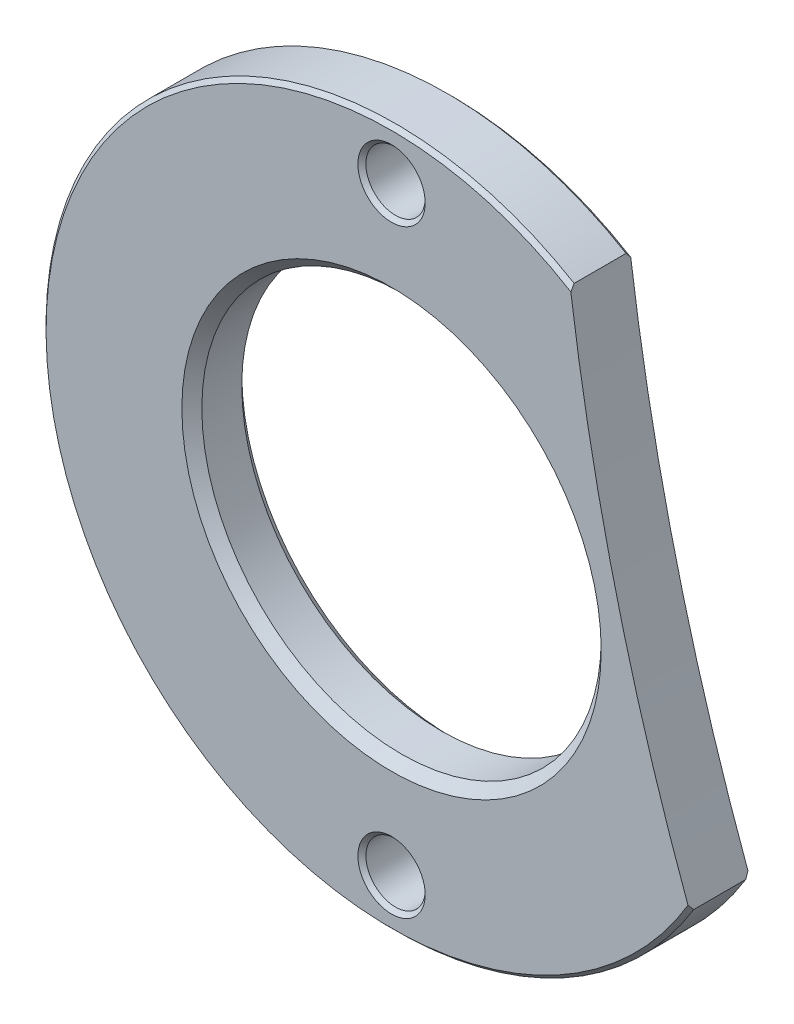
ISO-10303-21;
HEADER;
FILE_DESCRIPTION(('STEP AP214'),'2;1');
FILE_NAME('part.step','',(''),(''),'','','');
FILE_SCHEMA(('AUTOMOTIVE_DESIGN { 1 0 10303 214 1 1 1 1 }'));
ENDSEC;
DATA;
#1=APPLICATION_CONTEXT('core data for automotive mechanical design processes');
#2=APPLICATION_PROTOCOL_DEFINITION('international standard','automotive_design',2000,#1);
#3=PRODUCT_CONTEXT('',#1,'mechanical');
#4=PRODUCT('Part','Part','',(#3));
#5=PRODUCT_RELATED_PRODUCT_CATEGORY('part','',(#4));
#6=PRODUCT_DEFINITION_FORMATION('','',#4);
#7=PRODUCT_DEFINITION_CONTEXT('part definition',#1,'design');
#8=PRODUCT_DEFINITION('design','',#6,#7);
#9=PRODUCT_DEFINITION_SHAPE('','',#8);
#10=(LENGTH_UNIT() NAMED_UNIT(*) SI_UNIT(.MILLI.,.METRE.));
#11=(NAMED_UNIT(*) PLANE_ANGLE_UNIT() SI_UNIT($,.RADIAN.));
#12=(NAMED_UNIT(*) SI_UNIT($,.STERADIAN.) SOLID_ANGLE_UNIT());
#13=UNCERTAINTY_MEASURE_WITH_UNIT(LENGTH_MEASURE(1.E-05),#10,'distance_accuracy_value','');
#14=(GEOMETRIC_REPRESENTATION_CONTEXT(3) GLOBAL_UNCERTAINTY_ASSIGNED_CONTEXT((#13)) GLOBAL_UNIT_ASSIGNED_CONTEXT((#10,
#11,#12)) REPRESENTATION_CONTEXT('',''));
#15=CARTESIAN_POINT('',(0.,0.,0.));
#16=DIRECTION('',(0.,0.,1.));
#17=DIRECTION('',(1.,0.,0.));
#18=AXIS2_PLACEMENT_3D('',#15,#16,#17);
#19=CARTESIAN_POINT('',(59.5,14.75,3.));
#20=DIRECTION('',(0.,0.,1.));
#21=DIRECTION('',(1.,0.,0.));
#22=AXIS2_PLACEMENT_3D('',#19,#20,#21);
#23=PLANE('',#22);
#24=CARTESIAN_POINT('',(0.,-15.,3.));
#25=DIRECTION('',(0.,0.,1.));
#26=DIRECTION('',(1.,0.,0.));
#27=AXIS2_PLACEMENT_3D('',#24,#25,#26);
#28=CIRCLE('',#27,1.68499999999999);
#29=CARTESIAN_POINT('',(1.685,-15.,3.));
#30=VERTEX_POINT('',#29);
#31=EDGE_CURVE('E186',#30,#30,#28,.F.);
#32=ORIENTED_EDGE('',*,*,#31,.T.);
#33=EDGE_LOOP('',(#32));
#34=FACE_BOUND('',#33,.T.);
#35=CARTESIAN_POINT('',(0.,15.,3.));
#36=DIRECTION('',(0.,0.,1.));
#37=DIRECTION('',(1.,0.,0.));
#38=AXIS2_PLACEMENT_3D('',#35,#36,#37);
#39=CIRCLE('',#38,1.68499999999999);
#40=CARTESIAN_POINT('',(1.685,15.,3.));
#41=VERTEX_POINT('',#40);
#42=EDGE_CURVE('E188',#41,#41,#39,.F.);
#43=ORIENTED_EDGE('',*,*,#42,.T.);
#44=EDGE_LOOP('',(#43));
#45=FACE_BOUND('',#44,.T.);
#46=CARTESIAN_POINT('',(0.,0.,3.));
#47=DIRECTION('',(0.,0.,1.));
#48=DIRECTION('',(1.,0.,0.));
#49=AXIS2_PLACEMENT_3D('',#46,#47,#48);
#50=CIRCLE('',#49,10.5);
#51=CARTESIAN_POINT('',(10.5,0.,3.));
#52=VERTEX_POINT('',#51);
#53=EDGE_CURVE('E197',#52,#52,#50,.F.);
#54=ORIENTED_EDGE('',*,*,#53,.T.);
#55=EDGE_LOOP('',(#54));
#56=FACE_BOUND('',#55,.T.);
#57=CARTESIAN_POINT('',(119.,29.5,3.));
#58=DIRECTION('',(0.,0.,-1.));
#59=DIRECTION('',(1.,0.,0.));
#60=AXIS2_PLACEMENT_3D('',#57,#58,#59);
#61=CIRCLE('',#60,111.);
#62=CARTESIAN_POINT('',(14.8466473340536,-8.88071297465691,3.));
#63=VERTEX_POINT('',#62);
#64=CARTESIAN_POINT('',(8.97939906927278,14.7871698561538,3.));
#65=VERTEX_POINT('',#64);
#66=EDGE_CURVE('E83',#63,#65,#61,.T.);
#67=ORIENTED_EDGE('',*,*,#66,.T.);
#68=CARTESIAN_POINT('',(0.,0.,3.));
#69=DIRECTION('',(0.,0.,1.));
#70=DIRECTION('',(1.,0.,0.));
#71=AXIS2_PLACEMENT_3D('',#68,#69,#70);
#72=CIRCLE('',#71,17.3);
#73=EDGE_CURVE('E203',#65,#63,#72,.T.);
#74=ORIENTED_EDGE('',*,*,#73,.T.);
#75=EDGE_LOOP('',(#67,#74));
#76=FACE_BOUND('',#75,.T.);
#77=ADVANCED_FACE('F38',(#34,#45,#56,#76),#23,.T.);
#78=CARTESIAN_POINT('',(59.5,14.75,0.));
#79=DIRECTION('',(0.,0.,1.));
#80=DIRECTION('',(1.,0.,0.));
#81=AXIS2_PLACEMENT_3D('',#78,#79,#80);
#82=PLANE('',#81);
#83=CARTESIAN_POINT('',(0.,-15.,0.));
#84=DIRECTION('',(0.,0.,1.));
#85=DIRECTION('',(1.,0.,0.));
#86=AXIS2_PLACEMENT_3D('',#83,#84,#85);
#87=CIRCLE('',#86,1.685);
#88=CARTESIAN_POINT('',(1.685,-15.,0.));
#89=VERTEX_POINT('',#88);
#90=EDGE_CURVE('E179',#89,#89,#87,.T.);
#91=ORIENTED_EDGE('',*,*,#90,.T.);
#92=EDGE_LOOP('',(#91));
#93=FACE_BOUND('',#92,.T.);
#94=CARTESIAN_POINT('',(0.,15.,0.));
#95=DIRECTION('',(0.,0.,1.));
#96=DIRECTION('',(1.,0.,0.));
#97=AXIS2_PLACEMENT_3D('',#94,#95,#96);
#98=CIRCLE('',#97,1.685);
#99=CARTESIAN_POINT('',(1.685,15.,0.));
#100=VERTEX_POINT('',#99);
#101=EDGE_CURVE('E181',#100,#100,#98,.T.);
#102=ORIENTED_EDGE('',*,*,#101,.T.);
#103=EDGE_LOOP('',(#102));
#104=FACE_BOUND('',#103,.T.);
#105=CARTESIAN_POINT('',(0.,0.,0.));
#106=DIRECTION('',(0.,0.,1.));
#107=DIRECTION('',(1.,0.,0.));
#108=AXIS2_PLACEMENT_3D('',#105,#106,#107);
#109=CIRCLE('',#108,10.5);
#110=CARTESIAN_POINT('',(10.5,0.,0.));
#111=VERTEX_POINT('',#110);
#112=EDGE_CURVE('E100',#111,#111,#109,.T.);
#113=ORIENTED_EDGE('',*,*,#112,.T.);
#114=EDGE_LOOP('',(#113));
#115=FACE_BOUND('',#114,.T.);
#116=CARTESIAN_POINT('',(119.,29.5,0.));
#117=DIRECTION('',(0.,0.,-1.));
#118=DIRECTION('',(1.,0.,0.));
#119=AXIS2_PLACEMENT_3D('',#116,#117,#118);
#120=CIRCLE('',#119,111.);
#121=CARTESIAN_POINT('',(14.8466473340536,-8.88071297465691,0.));
#122=VERTEX_POINT('',#121);
#123=CARTESIAN_POINT('',(8.97939906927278,14.7871698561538,0.));
#124=VERTEX_POINT('',#123);
#125=EDGE_CURVE('E209',#122,#124,#120,.T.);
#126=ORIENTED_EDGE('',*,*,#125,.F.);
#127=CARTESIAN_POINT('',(0.,0.,0.));
#128=DIRECTION('',(0.,0.,1.));
#129=DIRECTION('',(1.,0.,0.));
#130=AXIS2_PLACEMENT_3D('',#127,#128,#129);
#131=CIRCLE('',#130,17.3);
#132=EDGE_CURVE('E204',#122,#124,#131,.F.);
#133=ORIENTED_EDGE('',*,*,#132,.T.);
#134=EDGE_LOOP('',(#126,#133));
#135=FACE_BOUND('',#134,.T.);
#136=ADVANCED_FACE('F122',(#93,#104,#115,#135),#82,.F.);
#137=CARTESIAN_POINT('',(119.,29.5,3.));
#138=DIRECTION('',(0.,0.,-1.));
#139=DIRECTION('',(-1.,0.,0.));
#140=AXIS2_PLACEMENT_3D('',#137,#138,#139);
#141=CYLINDRICAL_SURFACE('',#140,111.);
#142=DIRECTION('',(0.,0.,-1.));
#143=VECTOR('',#142,1.);
#144=CARTESIAN_POINT('',(14.9353560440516,-9.12058878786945,3.));
#145=LINE('',#144,#143);
#146=CARTESIAN_POINT('',(14.9353560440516,-9.12058878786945,2.8));
#147=VERTEX_POINT('',#146);
#148=CARTESIAN_POINT('',(14.9353560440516,-9.12058878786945,0.200000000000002));
#149=VERTEX_POINT('',#148);
#150=EDGE_CURVE('E82',#147,#149,#145,.T.);
#151=ORIENTED_EDGE('',*,*,#150,.T.);
#152=CARTESIAN_POINT('',(14.9353560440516,-9.12058878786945,0.200000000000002));
#153=CARTESIAN_POINT('',(14.9205508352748,-9.08069583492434,0.166572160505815));
#154=CARTESIAN_POINT('',(14.9057558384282,-9.0407597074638,0.133191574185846));
#155=CARTESIAN_POINT('',(14.8761862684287,-8.9608011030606,0.066524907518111));
#156=CARTESIAN_POINT('',(14.8614116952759,-8.92077862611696,0.0332388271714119));
#157=CARTESIAN_POINT('',(14.8466473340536,-8.88071297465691,0.));
#158=B_SPLINE_CURVE_WITH_KNOTS('',3,(#152,#153,#154,#155,#156,#157),.UNSPECIFIED.,.F.,.F.,(4,2,
4),(0.,0.162334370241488,0.324668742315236),.UNSPECIFIED.);
#159=EDGE_CURVE('E133',#149,#122,#158,.T.);
#160=ORIENTED_EDGE('',*,*,#159,.T.);
#161=ORIENTED_EDGE('',*,*,#125,.T.);
#162=CARTESIAN_POINT('',(8.97939906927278,14.7871698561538,0.));
#163=CARTESIAN_POINT('',(8.97373942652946,14.8294925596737,0.0332388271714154));
#164=CARTESIAN_POINT('',(8.96810897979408,14.8717818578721,0.0665249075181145));
#165=CARTESIAN_POINT('',(8.95690647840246,14.9562936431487,0.133191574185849));
#166=CARTESIAN_POINT('',(8.95133442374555,14.9985161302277,0.166572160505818));
#167=CARTESIAN_POINT('',(8.94579156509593,15.0407052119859,0.200000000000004));
#168=B_SPLINE_CURVE_WITH_KNOTS('',3,(#162,#163,#164,#165,#166,#167),.UNSPECIFIED.,.F.,.F.,(4,2,
4),(0.,0.162334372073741,0.324668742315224),.UNSPECIFIED.);
#169=CARTESIAN_POINT('',(8.94579156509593,15.0407052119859,0.200000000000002));
#170=VERTEX_POINT('',#169);
#171=EDGE_CURVE('E84',#124,#170,#168,.T.);
#172=ORIENTED_EDGE('',*,*,#171,.T.);
#173=DIRECTION('',(0.,0.,-1.));
#174=VECTOR('',#173,1.);
#175=CARTESIAN_POINT('',(8.94579156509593,15.0407052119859,3.));
#176=LINE('',#175,#174);
#177=CARTESIAN_POINT('',(8.94579156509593,15.0407052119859,2.8));
#178=VERTEX_POINT('',#177);
#179=EDGE_CURVE('E93',#178,#170,#176,.T.);
#180=ORIENTED_EDGE('',*,*,#179,.F.);
#181=CARTESIAN_POINT('',(8.94579156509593,15.0407052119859,2.8));
#182=CARTESIAN_POINT('',(8.95133442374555,14.9985161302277,2.83342783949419));
#183=CARTESIAN_POINT('',(8.95690647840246,14.9562936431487,2.86680842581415));
#184=CARTESIAN_POINT('',(8.96810897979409,14.8717818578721,2.93347509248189));
#185=CARTESIAN_POINT('',(8.97373942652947,14.8294925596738,2.96676117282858));
#186=CARTESIAN_POINT('',(8.97939906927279,14.7871698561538,3.));
#187=B_SPLINE_CURVE_WITH_KNOTS('',3,(#181,#182,#183,#184,#185,#186),.UNSPECIFIED.,.F.,.F.,(4,2,
4),(0.,0.162334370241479,0.324668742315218),.UNSPECIFIED.);
#188=EDGE_CURVE('E53',#178,#65,#187,.T.);
#189=ORIENTED_EDGE('',*,*,#188,.T.);
#190=ORIENTED_EDGE('',*,*,#66,.F.);
#191=CARTESIAN_POINT('',(14.8466473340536,-8.88071297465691,3.));
#192=CARTESIAN_POINT('',(14.8614116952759,-8.92077862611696,2.96676117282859));
#193=CARTESIAN_POINT('',(14.8761862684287,-8.9608011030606,2.93347509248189));
#194=CARTESIAN_POINT('',(14.9057558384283,-9.0407597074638,2.86680842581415));
#195=CARTESIAN_POINT('',(14.9205508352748,-9.08069583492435,2.83342783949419));
#196=CARTESIAN_POINT('',(14.9353560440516,-9.12058878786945,2.8));
#197=B_SPLINE_CURVE_WITH_KNOTS('',3,(#191,#192,#193,#194,#195,#196),.UNSPECIFIED.,.F.,.F.,(4,2,
4),(0.,0.162334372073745,0.324668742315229),.UNSPECIFIED.);
#198=EDGE_CURVE('E61',#63,#147,#197,.T.);
#199=ORIENTED_EDGE('',*,*,#198,.T.);
#200=EDGE_LOOP('',(#151,#160,#161,#172,#180,#189,#190,#199));
#201=FACE_BOUND('',#200,.T.);
#202=ADVANCED_FACE('F81',(#201),#141,.F.);
#203=CARTESIAN_POINT('',(0.,0.,3.));
#204=DIRECTION('',(0.,0.,-1.));
#205=DIRECTION('',(-1.,0.,0.));
#206=AXIS2_PLACEMENT_3D('',#203,#204,#205);
#207=CYLINDRICAL_SURFACE('',#206,17.5);
#208=ORIENTED_EDGE('',*,*,#179,.T.);
#209=CARTESIAN_POINT('',(0.,0.,0.200000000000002));
#210=DIRECTION('',(0.,0.,1.));
#211=DIRECTION('',(1.,0.,0.));
#212=AXIS2_PLACEMENT_3D('',#209,#210,#211);
#213=CIRCLE('',#212,17.5);
#214=EDGE_CURVE('E92',#170,#149,#213,.T.);
#215=ORIENTED_EDGE('',*,*,#214,.T.);
#216=ORIENTED_EDGE('',*,*,#150,.F.);
#217=CARTESIAN_POINT('',(0.,0.,2.8));
#218=DIRECTION('',(0.,0.,1.));
#219=DIRECTION('',(1.,0.,0.));
#220=AXIS2_PLACEMENT_3D('',#217,#218,#219);
#221=CIRCLE('',#220,17.5);
#222=EDGE_CURVE('E90',#147,#178,#221,.F.);
#223=ORIENTED_EDGE('',*,*,#222,.T.);
#224=EDGE_LOOP('',(#208,#215,#216,#223));
#225=FACE_BOUND('',#224,.T.);
#226=ADVANCED_FACE('F89',(#225),#207,.T.);
#227=CARTESIAN_POINT('',(0.,0.,3.));
#228=DIRECTION('',(0.,0.,-1.));
#229=DIRECTION('',(-1.,0.,0.));
#230=AXIS2_PLACEMENT_3D('',#227,#228,#229);
#231=CYLINDRICAL_SURFACE('',#230,10.);
#232=CARTESIAN_POINT('',(0.,0.,2.49999999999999));
#233=DIRECTION('',(0.,0.,1.));
#234=DIRECTION('',(1.,0.,0.));
#235=AXIS2_PLACEMENT_3D('',#232,#233,#234);
#236=CIRCLE('',#235,10.);
#237=CARTESIAN_POINT('',(10.,0.,2.49999999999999));
#238=VERTEX_POINT('',#237);
#239=EDGE_CURVE('E200',#238,#238,#236,.T.);
#240=ORIENTED_EDGE('',*,*,#239,.T.);
#241=EDGE_LOOP('',(#240));
#242=FACE_BOUND('',#241,.T.);
#243=CARTESIAN_POINT('',(0.,0.,0.500000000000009));
#244=DIRECTION('',(0.,0.,1.));
#245=DIRECTION('',(1.,0.,0.));
#246=AXIS2_PLACEMENT_3D('',#243,#244,#245);
#247=CIRCLE('',#246,10.);
#248=CARTESIAN_POINT('',(10.,0.,0.500000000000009));
#249=VERTEX_POINT('',#248);
#250=EDGE_CURVE('E96',#249,#249,#247,.F.);
#251=ORIENTED_EDGE('',*,*,#250,.T.);
#252=EDGE_LOOP('',(#251));
#253=FACE_BOUND('',#252,.T.);
#254=ADVANCED_FACE('F162',(#242,#253),#231,.F.);
#255=CARTESIAN_POINT('',(0.,-15.,3.));
#256=DIRECTION('',(0.,0.,1.));
#257=DIRECTION('',(1.,0.,0.));
#258=AXIS2_PLACEMENT_3D('',#255,#256,#257);
#259=CYLINDRICAL_SURFACE('',#258,1.48499999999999);
#260=CARTESIAN_POINT('',(0.,-15.,2.8));
#261=DIRECTION('',(0.,0.,1.));
#262=DIRECTION('',(1.,0.,0.));
#263=AXIS2_PLACEMENT_3D('',#260,#261,#262);
#264=CIRCLE('',#263,1.48499999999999);
#265=CARTESIAN_POINT('',(1.485,-15.,2.8));
#266=VERTEX_POINT('',#265);
#267=EDGE_CURVE('E191',#266,#266,#264,.T.);
#268=ORIENTED_EDGE('',*,*,#267,.T.);
#269=EDGE_LOOP('',(#268));
#270=FACE_BOUND('',#269,.T.);
#271=CARTESIAN_POINT('',(0.,-15.,0.200000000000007));
#272=DIRECTION('',(0.,0.,1.));
#273=DIRECTION('',(1.,0.,0.));
#274=AXIS2_PLACEMENT_3D('',#271,#272,#273);
#275=CIRCLE('',#274,1.48499999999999);
#276=CARTESIAN_POINT('',(1.485,-15.,0.200000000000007));
#277=VERTEX_POINT('',#276);
#278=EDGE_CURVE('E194',#277,#277,#275,.F.);
#279=ORIENTED_EDGE('',*,*,#278,.T.);
#280=EDGE_LOOP('',(#279));
#281=FACE_BOUND('',#280,.T.);
#282=ADVANCED_FACE('F165',(#270,#281),#259,.F.);
#283=CARTESIAN_POINT('',(0.,15.,3.));
#284=DIRECTION('',(0.,0.,1.));
#285=DIRECTION('',(1.,0.,0.));
#286=AXIS2_PLACEMENT_3D('',#283,#284,#285);
#287=CYLINDRICAL_SURFACE('',#286,1.48499999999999);
#288=CARTESIAN_POINT('',(0.,15.,2.8));
#289=DIRECTION('',(0.,0.,1.));
#290=DIRECTION('',(1.,0.,0.));
#291=AXIS2_PLACEMENT_3D('',#288,#289,#290);
#292=CIRCLE('',#291,1.48499999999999);
#293=CARTESIAN_POINT('',(1.485,15.,2.8));
#294=VERTEX_POINT('',#293);
#295=EDGE_CURVE('E11',#294,#294,#292,.T.);
#296=ORIENTED_EDGE('',*,*,#295,.T.);
#297=EDGE_LOOP('',(#296));
#298=FACE_BOUND('',#297,.T.);
#299=CARTESIAN_POINT('',(0.,15.,0.200000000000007));
#300=DIRECTION('',(0.,0.,1.));
#301=DIRECTION('',(1.,0.,0.));
#302=AXIS2_PLACEMENT_3D('',#299,#300,#301);
#303=CIRCLE('',#302,1.48499999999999);
#304=CARTESIAN_POINT('',(1.485,15.,0.200000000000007));
#305=VERTEX_POINT('',#304);
#306=EDGE_CURVE('E46',#305,#305,#303,.F.);
#307=ORIENTED_EDGE('',*,*,#306,.T.);
#308=EDGE_LOOP('',(#307));
#309=FACE_BOUND('',#308,.T.);
#310=ADVANCED_FACE('F149',(#298,#309),#287,.F.);
#311=CARTESIAN_POINT('',(0.,0.,0.));
#312=DIRECTION('',(0.,0.,-1.));
#313=DIRECTION('',(-1.,0.,0.));
#314=AXIS2_PLACEMENT_3D('',#311,#312,#313);
#315=CONICAL_SURFACE('',#314,10.5,0.785398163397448);
#316=ORIENTED_EDGE('',*,*,#250,.F.);
#317=EDGE_LOOP('',(#316));
#318=FACE_BOUND('',#317,.T.);
#319=ORIENTED_EDGE('',*,*,#112,.F.);
#320=EDGE_LOOP('',(#319));
#321=FACE_BOUND('',#320,.T.);
#322=ADVANCED_FACE('F124',(#318,#321),#315,.F.);
#323=CARTESIAN_POINT('',(0.,0.,0.200000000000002));
#324=DIRECTION('',(0.,0.,1.));
#325=DIRECTION('',(1.,0.,0.));
#326=AXIS2_PLACEMENT_3D('',#323,#324,#325);
#327=CONICAL_SURFACE('',#326,17.5,0.785398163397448);
#328=ORIENTED_EDGE('',*,*,#171,.F.);
#329=ORIENTED_EDGE('',*,*,#132,.F.);
#330=ORIENTED_EDGE('',*,*,#159,.F.);
#331=ORIENTED_EDGE('',*,*,#214,.F.);
#332=EDGE_LOOP('',(#328,#329,#330,#331));
#333=FACE_BOUND('',#332,.T.);
#334=ADVANCED_FACE('F139',(#333),#327,.T.);
#335=CARTESIAN_POINT('',(0.,0.,3.));
#336=DIRECTION('',(0.,0.,-1.));
#337=DIRECTION('',(-1.,0.,0.));
#338=AXIS2_PLACEMENT_3D('',#335,#336,#337);
#339=CONICAL_SURFACE('',#338,17.3,0.78539816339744);
#340=ORIENTED_EDGE('',*,*,#188,.F.);
#341=ORIENTED_EDGE('',*,*,#222,.F.);
#342=ORIENTED_EDGE('',*,*,#198,.F.);
#343=ORIENTED_EDGE('',*,*,#73,.F.);
#344=EDGE_LOOP('',(#340,#341,#342,#343));
#345=FACE_BOUND('',#344,.T.);
#346=ADVANCED_FACE('F95',(#345),#339,.T.);
#347=CARTESIAN_POINT('',(0.,0.,2.49999999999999));
#348=DIRECTION('',(0.,0.,1.));
#349=DIRECTION('',(1.,0.,0.));
#350=AXIS2_PLACEMENT_3D('',#347,#348,#349);
#351=CONICAL_SURFACE('',#350,10.,0.785398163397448);
#352=ORIENTED_EDGE('',*,*,#53,.F.);
#353=EDGE_LOOP('',(#352));
#354=FACE_BOUND('',#353,.T.);
#355=ORIENTED_EDGE('',*,*,#239,.F.);
#356=EDGE_LOOP('',(#355));
#357=FACE_BOUND('',#356,.T.);
#358=ADVANCED_FACE('F148',(#354,#357),#351,.F.);
#359=CARTESIAN_POINT('',(0.,-15.,2.8));
#360=DIRECTION('',(0.,0.,1.));
#361=DIRECTION('',(1.,0.,0.));
#362=AXIS2_PLACEMENT_3D('',#359,#360,#361);
#363=CONICAL_SURFACE('',#362,1.48499999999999,0.785398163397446);
#364=CARTESIAN_POINT('',(1.685,-15.,3.));
#365=CARTESIAN_POINT('',(1.68291666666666,-15.,2.99791666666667));
#366=CARTESIAN_POINT('',(1.68083333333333,-15.,2.99583333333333));
#367=CARTESIAN_POINT('',(1.67666666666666,-15.,2.99166666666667));
#368=CARTESIAN_POINT('',(1.67458333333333,-15.,2.98958333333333));
#369=CARTESIAN_POINT('',(1.67041666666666,-15.,2.98541666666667));
#370=CARTESIAN_POINT('',(1.66833333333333,-15.,2.98333333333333));
#371=CARTESIAN_POINT('',(1.66416666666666,-15.,2.97916666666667));
#372=CARTESIAN_POINT('',(1.66208333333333,-15.,2.97708333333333));
#373=CARTESIAN_POINT('',(1.65791666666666,-15.,2.97291666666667));
#374=CARTESIAN_POINT('',(1.65583333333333,-15.,2.97083333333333));
#375=CARTESIAN_POINT('',(1.65166666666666,-15.,2.96666666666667));
#376=CARTESIAN_POINT('',(1.64958333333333,-15.,2.96458333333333));
#377=CARTESIAN_POINT('',(1.64541666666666,-15.,2.96041666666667));
#378=CARTESIAN_POINT('',(1.64333333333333,-15.,2.95833333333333));
#379=CARTESIAN_POINT('',(1.63916666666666,-15.,2.95416666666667));
#380=CARTESIAN_POINT('',(1.63708333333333,-15.,2.95208333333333));
#381=CARTESIAN_POINT('',(1.63291666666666,-15.,2.94791666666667));
#382=CARTESIAN_POINT('',(1.63083333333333,-15.,2.94583333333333));
#383=CARTESIAN_POINT('',(1.62666666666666,-15.,2.94166666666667));
#384=CARTESIAN_POINT('',(1.62458333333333,-15.,2.93958333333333));
#385=CARTESIAN_POINT('',(1.62041666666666,-15.,2.93541666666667));
#386=CARTESIAN_POINT('',(1.61833333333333,-15.,2.93333333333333));
#387=CARTESIAN_POINT('',(1.61416666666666,-15.,2.92916666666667));
#388=CARTESIAN_POINT('',(1.61208333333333,-15.,2.92708333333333));
#389=CARTESIAN_POINT('',(1.60791666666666,-15.,2.92291666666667));
#390=CARTESIAN_POINT('',(1.60583333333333,-15.,2.92083333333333));
#391=CARTESIAN_POINT('',(1.60166666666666,-15.,2.91666666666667));
#392=CARTESIAN_POINT('',(1.59958333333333,-15.,2.91458333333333));
#393=CARTESIAN_POINT('',(1.59541666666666,-15.,2.91041666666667));
#394=CARTESIAN_POINT('',(1.59333333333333,-15.,2.90833333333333));
#395=CARTESIAN_POINT('',(1.58916666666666,-15.,2.90416666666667));
#396=CARTESIAN_POINT('',(1.58708333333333,-15.,2.90208333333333));
#397=CARTESIAN_POINT('',(1.58291666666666,-15.,2.89791666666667));
#398=CARTESIAN_POINT('',(1.58083333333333,-15.,2.89583333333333));
#399=CARTESIAN_POINT('',(1.57666666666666,-15.,2.89166666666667));
#400=CARTESIAN_POINT('',(1.57458333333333,-15.,2.88958333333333));
#401=CARTESIAN_POINT('',(1.57041666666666,-15.,2.88541666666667));
#402=CARTESIAN_POINT('',(1.56833333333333,-15.,2.88333333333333));
#403=CARTESIAN_POINT('',(1.56416666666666,-15.,2.87916666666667));
#404=CARTESIAN_POINT('',(1.56208333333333,-15.,2.87708333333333));
#405=CARTESIAN_POINT('',(1.55791666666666,-15.,2.87291666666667));
#406=CARTESIAN_POINT('',(1.55583333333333,-15.,2.87083333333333));
#407=CARTESIAN_POINT('',(1.55166666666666,-15.,2.86666666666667));
#408=CARTESIAN_POINT('',(1.54958333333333,-15.,2.86458333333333));
#409=CARTESIAN_POINT('',(1.54541666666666,-15.,2.86041666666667));
#410=CARTESIAN_POINT('',(1.54333333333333,-15.,2.85833333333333));
#411=CARTESIAN_POINT('',(1.53916666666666,-15.,2.85416666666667));
#412=CARTESIAN_POINT('',(1.53708333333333,-15.,2.85208333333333));
#413=CARTESIAN_POINT('',(1.53291666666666,-15.,2.84791666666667));
#414=CARTESIAN_POINT('',(1.53083333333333,-15.,2.84583333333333));
#415=CARTESIAN_POINT('',(1.52666666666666,-15.,2.84166666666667));
#416=CARTESIAN_POINT('',(1.52458333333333,-15.,2.83958333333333));
#417=CARTESIAN_POINT('',(1.52041666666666,-15.,2.83541666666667));
#418=CARTESIAN_POINT('',(1.51833333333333,-15.,2.83333333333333));
#419=CARTESIAN_POINT('',(1.51416666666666,-15.,2.82916666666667));
#420=CARTESIAN_POINT('',(1.51208333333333,-15.,2.82708333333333));
#421=CARTESIAN_POINT('',(1.50791666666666,-15.,2.82291666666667));
#422=CARTESIAN_POINT('',(1.50583333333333,-15.,2.82083333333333));
#423=CARTESIAN_POINT('',(1.50166666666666,-15.,2.81666666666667));
#424=CARTESIAN_POINT('',(1.49958333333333,-15.,2.81458333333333));
#425=CARTESIAN_POINT('',(1.49541666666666,-15.,2.81041666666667));
#426=CARTESIAN_POINT('',(1.49333333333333,-15.,2.80833333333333));
#427=CARTESIAN_POINT('',(1.48916666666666,-15.,2.80416666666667));
#428=CARTESIAN_POINT('',(1.48708333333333,-15.,2.80208333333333));
#429=CARTESIAN_POINT('',(1.485,-15.,2.8));
#430=B_SPLINE_CURVE_WITH_KNOTS('',3,(#364,#365,#366,#367,#368,#369,#370,#371,#372,#373,#374,
#375,#376,#377,#378,#379,#380,#381,#382,#383,#384,#385,#386,#387,#388,#389,#390,#391,#392,#393,
#394,#395,#396,#397,#398,#399,#400,#401,#402,#403,#404,#405,#406,#407,#408,#409,#410,#411,#412,
#413,#414,#415,#416,#417,#418,#419,#420,#421,#422,#423,#424,#425,#426,#427,#428,#429),
.UNSPECIFIED.,.F.,.F.,(4,2,2,2,2,2,2,2,2,2,2,2,2,2,2,2,2,2,2,2,2,2,2,2,2,2,2,2,2,2,2,2,4),(0.,
0.00883883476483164,0.0176776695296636,0.0265165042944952,0.0353553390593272,0.0441941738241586,
0.0530330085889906,0.0618718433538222,0.0707106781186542,0.0795495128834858,0.0883883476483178,
0.0972271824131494,0.106066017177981,0.114904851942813,0.123743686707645,0.132582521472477,
0.141421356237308,0.15026019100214,0.159099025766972,0.167937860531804,0.176776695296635,
0.185615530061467,0.194454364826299,0.203293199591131,0.212132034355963,0.220970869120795,
0.229809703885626,0.238648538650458,0.24748737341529,0.256326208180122,0.265165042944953,
0.274003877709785,0.282842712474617),.UNSPECIFIED.);
#431=EDGE_CURVE('BSEAM222',#30,#266,#430,.T.);
#432=ORIENTED_EDGE('',*,*,#31,.F.);
#433=ORIENTED_EDGE('',*,*,#267,.F.);
#434=ORIENTED_EDGE('',*,*,#431,.T.);
#435=ORIENTED_EDGE('',*,*,#431,.F.);
#436=EDGE_LOOP('',(#432,#434,#433,#435));
#437=FACE_BOUND('',#436,.T.);
#438=ADVANCED_FACE('F222',(#437),#363,.F.);
#439=CARTESIAN_POINT('',(0.,-15.,0.));
#440=DIRECTION('',(0.,0.,-1.));
#441=DIRECTION('',(-1.,0.,0.));
#442=AXIS2_PLACEMENT_3D('',#439,#440,#441);
#443=CONICAL_SURFACE('',#442,1.685,0.785398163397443);
#444=ORIENTED_EDGE('',*,*,#278,.F.);
#445=EDGE_LOOP('',(#444));
#446=FACE_BOUND('',#445,.T.);
#447=ORIENTED_EDGE('',*,*,#90,.F.);
#448=EDGE_LOOP('',(#447));
#449=FACE_BOUND('',#448,.T.);
#450=ADVANCED_FACE('F227',(#446,#449),#443,.F.);
#451=CARTESIAN_POINT('',(0.,15.,2.8));
#452=DIRECTION('',(0.,0.,1.));
#453=DIRECTION('',(1.,0.,0.));
#454=AXIS2_PLACEMENT_3D('',#451,#452,#453);
#455=CONICAL_SURFACE('',#454,1.48499999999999,0.785398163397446);
#456=CARTESIAN_POINT('',(1.685,15.,3.));
#457=CARTESIAN_POINT('',(1.68291666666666,15.,2.99791666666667));
#458=CARTESIAN_POINT('',(1.68083333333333,15.,2.99583333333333));
#459=CARTESIAN_POINT('',(1.67666666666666,15.,2.99166666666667));
#460=CARTESIAN_POINT('',(1.67458333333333,15.,2.98958333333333));
#461=CARTESIAN_POINT('',(1.67041666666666,15.,2.98541666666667));
#462=CARTESIAN_POINT('',(1.66833333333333,15.,2.98333333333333));
#463=CARTESIAN_POINT('',(1.66416666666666,15.,2.97916666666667));
#464=CARTESIAN_POINT('',(1.66208333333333,15.,2.97708333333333));
#465=CARTESIAN_POINT('',(1.65791666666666,15.,2.97291666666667));
#466=CARTESIAN_POINT('',(1.65583333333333,15.,2.97083333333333));
#467=CARTESIAN_POINT('',(1.65166666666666,15.,2.96666666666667));
#468=CARTESIAN_POINT('',(1.64958333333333,15.,2.96458333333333));
#469=CARTESIAN_POINT('',(1.64541666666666,15.,2.96041666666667));
#470=CARTESIAN_POINT('',(1.64333333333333,15.,2.95833333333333));
#471=CARTESIAN_POINT('',(1.63916666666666,15.,2.95416666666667));
#472=CARTESIAN_POINT('',(1.63708333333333,15.,2.95208333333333));
#473=CARTESIAN_POINT('',(1.63291666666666,15.,2.94791666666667));
#474=CARTESIAN_POINT('',(1.63083333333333,15.,2.94583333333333));
#475=CARTESIAN_POINT('',(1.62666666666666,15.,2.94166666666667));
#476=CARTESIAN_POINT('',(1.62458333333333,15.,2.93958333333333));
#477=CARTESIAN_POINT('',(1.62041666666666,15.,2.93541666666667));
#478=CARTESIAN_POINT('',(1.61833333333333,15.,2.93333333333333));
#479=CARTESIAN_POINT('',(1.61416666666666,15.,2.92916666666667));
#480=CARTESIAN_POINT('',(1.61208333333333,15.,2.92708333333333));
#481=CARTESIAN_POINT('',(1.60791666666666,15.,2.92291666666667));
#482=CARTESIAN_POINT('',(1.60583333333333,15.,2.92083333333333));
#483=CARTESIAN_POINT('',(1.60166666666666,15.,2.91666666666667));
#484=CARTESIAN_POINT('',(1.59958333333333,15.,2.91458333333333));
#485=CARTESIAN_POINT('',(1.59541666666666,15.,2.91041666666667));
#486=CARTESIAN_POINT('',(1.59333333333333,15.,2.90833333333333));
#487=CARTESIAN_POINT('',(1.58916666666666,15.,2.90416666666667));
#488=CARTESIAN_POINT('',(1.58708333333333,15.,2.90208333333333));
#489=CARTESIAN_POINT('',(1.58291666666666,15.,2.89791666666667));
#490=CARTESIAN_POINT('',(1.58083333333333,15.,2.89583333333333));
#491=CARTESIAN_POINT('',(1.57666666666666,15.,2.89166666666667));
#492=CARTESIAN_POINT('',(1.57458333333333,15.,2.88958333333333));
#493=CARTESIAN_POINT('',(1.57041666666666,15.,2.88541666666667));
#494=CARTESIAN_POINT('',(1.56833333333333,15.,2.88333333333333));
#495=CARTESIAN_POINT('',(1.56416666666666,15.,2.87916666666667));
#496=CARTESIAN_POINT('',(1.56208333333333,15.,2.87708333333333));
#497=CARTESIAN_POINT('',(1.55791666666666,15.,2.87291666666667));
#498=CARTESIAN_POINT('',(1.55583333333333,15.,2.87083333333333));
#499=CARTESIAN_POINT('',(1.55166666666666,15.,2.86666666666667));
#500=CARTESIAN_POINT('',(1.54958333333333,15.,2.86458333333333));
#501=CARTESIAN_POINT('',(1.54541666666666,15.,2.86041666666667));
#502=CARTESIAN_POINT('',(1.54333333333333,15.,2.85833333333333));
#503=CARTESIAN_POINT('',(1.53916666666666,15.,2.85416666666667));
#504=CARTESIAN_POINT('',(1.53708333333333,15.,2.85208333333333));
#505=CARTESIAN_POINT('',(1.53291666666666,15.,2.84791666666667));
#506=CARTESIAN_POINT('',(1.53083333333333,15.,2.84583333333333));
#507=CARTESIAN_POINT('',(1.52666666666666,15.,2.84166666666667));
#508=CARTESIAN_POINT('',(1.52458333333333,15.,2.83958333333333));
#509=CARTESIAN_POINT('',(1.52041666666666,15.,2.83541666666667));
#510=CARTESIAN_POINT('',(1.51833333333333,15.,2.83333333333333));
#511=CARTESIAN_POINT('',(1.51416666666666,15.,2.82916666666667));
#512=CARTESIAN_POINT('',(1.51208333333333,15.,2.82708333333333));
#513=CARTESIAN_POINT('',(1.50791666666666,15.,2.82291666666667));
#514=CARTESIAN_POINT('',(1.50583333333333,15.,2.82083333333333));
#515=CARTESIAN_POINT('',(1.50166666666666,15.,2.81666666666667));
#516=CARTESIAN_POINT('',(1.49958333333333,15.,2.81458333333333));
#517=CARTESIAN_POINT('',(1.49541666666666,15.,2.81041666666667));
#518=CARTESIAN_POINT('',(1.49333333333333,15.,2.80833333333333));
#519=CARTESIAN_POINT('',(1.48916666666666,15.,2.80416666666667));
#520=CARTESIAN_POINT('',(1.48708333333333,15.,2.80208333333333));
#521=CARTESIAN_POINT('',(1.485,15.,2.8));
#522=B_SPLINE_CURVE_WITH_KNOTS('',3,(#456,#457,#458,#459,#460,#461,#462,#463,#464,#465,#466,
#467,#468,#469,#470,#471,#472,#473,#474,#475,#476,#477,#478,#479,#480,#481,#482,#483,#484,#485,
#486,#487,#488,#489,#490,#491,#492,#493,#494,#495,#496,#497,#498,#499,#500,#501,#502,#503,#504,
#505,#506,#507,#508,#509,#510,#511,#512,#513,#514,#515,#516,#517,#518,#519,#520,#521),
.UNSPECIFIED.,.F.,.F.,(4,2,2,2,2,2,2,2,2,2,2,2,2,2,2,2,2,2,2,2,2,2,2,2,2,2,2,2,2,2,2,2,4),(0.,
0.00883883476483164,0.0176776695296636,0.0265165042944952,0.0353553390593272,0.0441941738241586,
0.0530330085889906,0.0618718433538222,0.0707106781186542,0.0795495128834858,0.0883883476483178,
0.0972271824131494,0.106066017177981,0.114904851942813,0.123743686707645,0.132582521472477,
0.141421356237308,0.15026019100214,0.159099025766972,0.167937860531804,0.176776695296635,
0.185615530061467,0.194454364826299,0.203293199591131,0.212132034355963,0.220970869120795,
0.229809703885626,0.238648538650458,0.24748737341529,0.256326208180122,0.265165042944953,
0.274003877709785,0.282842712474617),.UNSPECIFIED.);
#523=EDGE_CURVE('BSEAM233',#41,#294,#522,.T.);
#524=ORIENTED_EDGE('',*,*,#42,.F.);
#525=ORIENTED_EDGE('',*,*,#295,.F.);
#526=ORIENTED_EDGE('',*,*,#523,.T.);
#527=ORIENTED_EDGE('',*,*,#523,.F.);
#528=EDGE_LOOP('',(#524,#526,#525,#527));
#529=FACE_BOUND('',#528,.T.);
#530=ADVANCED_FACE('F233',(#529),#455,.F.);
#531=CARTESIAN_POINT('',(0.,15.,0.));
#532=DIRECTION('',(0.,0.,-1.));
#533=DIRECTION('',(-1.,0.,0.));
#534=AXIS2_PLACEMENT_3D('',#531,#532,#533);
#535=CONICAL_SURFACE('',#534,1.685,0.785398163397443);
#536=ORIENTED_EDGE('',*,*,#306,.F.);
#537=EDGE_LOOP('',(#536));
#538=FACE_BOUND('',#537,.T.);
#539=ORIENTED_EDGE('',*,*,#101,.F.);
#540=EDGE_LOOP('',(#539));
#541=FACE_BOUND('',#540,.T.);
#542=ADVANCED_FACE('F40',(#538,#541),#535,.F.);
#543=CLOSED_SHELL('',(#77,#136,#202,#226,#254,#282,#310,#322,#334,#346,#358,#438,#450,#530,#542));
#544=MANIFOLD_SOLID_BREP('B2',#543);
#545=ADVANCED_BREP_SHAPE_REPRESENTATION('',(#18,#544),#14);
#546=SHAPE_DEFINITION_REPRESENTATION(#9,#545);
ENDSEC;
END-ISO-10303-21;
